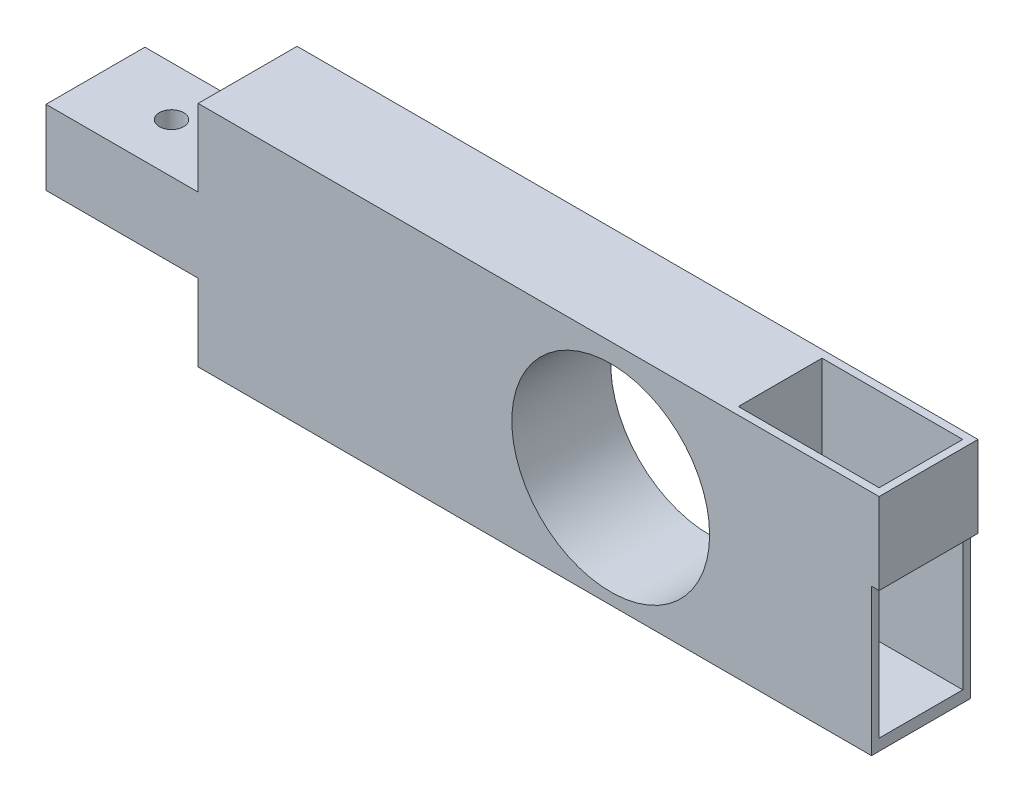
ISO-10303-21;
HEADER;
FILE_DESCRIPTION(('STEP AP214'),'2;1');
FILE_NAME('part.step','',(''),(''),'','','');
FILE_SCHEMA(('AUTOMOTIVE_DESIGN { 1 0 10303 214 1 1 1 1 }'));
ENDSEC;
DATA;
#1=APPLICATION_CONTEXT('core data for automotive mechanical design processes');
#2=APPLICATION_PROTOCOL_DEFINITION('international standard','automotive_design',2000,#1);
#3=PRODUCT_CONTEXT('',#1,'mechanical');
#4=PRODUCT('Part','Part','',(#3));
#5=PRODUCT_RELATED_PRODUCT_CATEGORY('part','',(#4));
#6=PRODUCT_DEFINITION_FORMATION('','',#4);
#7=PRODUCT_DEFINITION_CONTEXT('part definition',#1,'design');
#8=PRODUCT_DEFINITION('design','',#6,#7);
#9=PRODUCT_DEFINITION_SHAPE('','',#8);
#10=(LENGTH_UNIT() NAMED_UNIT(*) SI_UNIT(.MILLI.,.METRE.));
#11=(NAMED_UNIT(*) PLANE_ANGLE_UNIT() SI_UNIT($,.RADIAN.));
#12=(NAMED_UNIT(*) SI_UNIT($,.STERADIAN.) SOLID_ANGLE_UNIT());
#13=UNCERTAINTY_MEASURE_WITH_UNIT(LENGTH_MEASURE(1.E-05),#10,'distance_accuracy_value','');
#14=(GEOMETRIC_REPRESENTATION_CONTEXT(3) GLOBAL_UNCERTAINTY_ASSIGNED_CONTEXT((#13)) GLOBAL_UNIT_ASSIGNED_CONTEXT((#10,
#11,#12)) REPRESENTATION_CONTEXT('',''));
#15=CARTESIAN_POINT('',(0.,0.,0.));
#16=DIRECTION('',(0.,0.,1.));
#17=DIRECTION('',(1.,0.,0.));
#18=AXIS2_PLACEMENT_3D('',#15,#16,#17);
#19=CARTESIAN_POINT('',(350.325,30.,0.));
#20=DIRECTION('',(-1.,0.,0.));
#21=DIRECTION('',(0.,0.,1.));
#22=AXIS2_PLACEMENT_3D('',#19,#20,#21);
#23=PLANE('',#22);
#24=DIRECTION('',(0.,0.,-1.));
#25=VECTOR('',#24,1.);
#26=CARTESIAN_POINT('',(350.325,30.,0.));
#27=LINE('',#26,#25);
#28=CARTESIAN_POINT('',(350.325,30.,12.));
#29=VERTEX_POINT('',#28);
#30=CARTESIAN_POINT('',(350.325,30.,0.999999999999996));
#31=VERTEX_POINT('',#30);
#32=EDGE_CURVE('E164',#29,#31,#27,.T.);
#33=ORIENTED_EDGE('',*,*,#32,.F.);
#34=DIRECTION('',(0.,1.,0.));
#35=VECTOR('',#34,1.);
#36=CARTESIAN_POINT('',(350.325,-17.0172369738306,12.));
#37=LINE('',#36,#35);
#38=CARTESIAN_POINT('',(350.325,1.50000000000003,12.));
#39=VERTEX_POINT('',#38);
#40=EDGE_CURVE('E195',#39,#29,#37,.T.);
#41=ORIENTED_EDGE('',*,*,#40,.F.);
#42=DIRECTION('',(0.,0.,1.));
#43=VECTOR('',#42,1.);
#44=CARTESIAN_POINT('',(350.325,1.50000000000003,11.25));
#45=LINE('',#44,#43);
#46=CARTESIAN_POINT('',(350.325,1.50000000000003,0.999999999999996));
#47=VERTEX_POINT('',#46);
#48=EDGE_CURVE('E182',#47,#39,#45,.T.);
#49=ORIENTED_EDGE('',*,*,#48,.F.);
#50=DIRECTION('',(0.,1.,0.));
#51=VECTOR('',#50,1.);
#52=CARTESIAN_POINT('',(350.325,-17.0172369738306,0.999999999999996));
#53=LINE('',#52,#51);
#54=EDGE_CURVE('E181',#47,#31,#53,.T.);
#55=ORIENTED_EDGE('',*,*,#54,.T.);
#56=EDGE_LOOP('',(#33,#41,#49,#55));
#57=FACE_BOUND('',#56,.T.);
#58=ADVANCED_FACE('F39',(#57),#23,.F.);
#59=CARTESIAN_POINT('',(0.,0.,13.));
#60=DIRECTION('',(0.,1.,0.));
#61=DIRECTION('',(0.,0.,1.));
#62=AXIS2_PLACEMENT_3D('',#59,#60,#61);
#63=PLANE('',#62);
#64=DIRECTION('',(1.,0.,0.));
#65=VECTOR('',#64,1.);
#66=CARTESIAN_POINT('',(0.,0.,13.));
#67=LINE('',#66,#65);
#68=CARTESIAN_POINT('',(280.325,0.,13.));
#69=VERTEX_POINT('',#68);
#70=CARTESIAN_POINT('',(368.825,0.,13.));
#71=VERTEX_POINT('',#70);
#72=EDGE_CURVE('E293',#69,#71,#67,.T.);
#73=ORIENTED_EDGE('',*,*,#72,.F.);
#74=DIRECTION('',(0.,0.,1.));
#75=VECTOR('',#74,1.);
#76=CARTESIAN_POINT('',(280.325,0.,0.));
#77=LINE('',#76,#75);
#78=CARTESIAN_POINT('',(280.325,0.,0.));
#79=VERTEX_POINT('',#78);
#80=EDGE_CURVE('E266',#79,#69,#77,.T.);
#81=ORIENTED_EDGE('',*,*,#80,.F.);
#82=DIRECTION('',(1.,0.,0.));
#83=VECTOR('',#82,1.);
#84=CARTESIAN_POINT('',(0.,0.,0.));
#85=LINE('',#84,#83);
#86=CARTESIAN_POINT('',(368.825,0.,0.));
#87=VERTEX_POINT('',#86);
#88=EDGE_CURVE('E292',#79,#87,#85,.T.);
#89=ORIENTED_EDGE('',*,*,#88,.T.);
#90=DIRECTION('',(0.,0.,-1.));
#91=VECTOR('',#90,1.);
#92=CARTESIAN_POINT('',(368.825,0.,13.));
#93=LINE('',#92,#91);
#94=EDGE_CURVE('E234',#71,#87,#93,.T.);
#95=ORIENTED_EDGE('',*,*,#94,.F.);
#96=EDGE_LOOP('',(#73,#81,#89,#95));
#97=FACE_BOUND('',#96,.T.);
#98=ADVANCED_FACE('F41',(#97),#63,.F.);
#99=CARTESIAN_POINT('',(0.,30.,13.));
#100=DIRECTION('',(0.,1.,0.));
#101=DIRECTION('',(-1.,0.,0.));
#102=AXIS2_PLACEMENT_3D('',#99,#100,#101);
#103=PLANE('',#102);
#104=DIRECTION('',(-1.,0.,0.));
#105=VECTOR('',#104,1.);
#106=CARTESIAN_POINT('',(350.325,30.,0.999999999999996));
#107=LINE('',#106,#105);
#108=CARTESIAN_POINT('',(368.825,30.,0.999999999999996));
#109=VERTEX_POINT('',#108);
#110=EDGE_CURVE('E170',#109,#31,#107,.T.);
#111=ORIENTED_EDGE('',*,*,#110,.F.);
#112=DIRECTION('',(0.,0.,1.));
#113=VECTOR('',#112,1.);
#114=CARTESIAN_POINT('',(368.825,30.,13.));
#115=LINE('',#114,#113);
#116=CARTESIAN_POINT('',(368.825,30.,11.25));
#117=VERTEX_POINT('',#116);
#118=EDGE_CURVE('E214',#109,#117,#115,.T.);
#119=ORIENTED_EDGE('',*,*,#118,.T.);
#120=DIRECTION('',(-1.,0.,0.));
#121=VECTOR('',#120,1.);
#122=CARTESIAN_POINT('',(350.325,30.,11.25));
#123=LINE('',#122,#121);
#124=CARTESIAN_POINT('',(368.827042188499,30.,11.25));
#125=VERTEX_POINT('',#124);
#126=EDGE_CURVE('E203',#125,#117,#123,.T.);
#127=ORIENTED_EDGE('',*,*,#126,.F.);
#128=DIRECTION('',(0.,0.,-1.));
#129=VECTOR('',#128,1.);
#130=CARTESIAN_POINT('',(368.827042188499,30.,11.25));
#131=LINE('',#130,#129);
#132=CARTESIAN_POINT('',(368.827042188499,30.,12.));
#133=VERTEX_POINT('',#132);
#134=EDGE_CURVE('E191',#133,#125,#131,.T.);
#135=ORIENTED_EDGE('',*,*,#134,.F.);
#136=DIRECTION('',(1.,0.,0.));
#137=VECTOR('',#136,1.);
#138=CARTESIAN_POINT('',(350.325,30.,12.));
#139=LINE('',#138,#137);
#140=EDGE_CURVE('E173',#29,#133,#139,.T.);
#141=ORIENTED_EDGE('',*,*,#140,.F.);
#142=ORIENTED_EDGE('',*,*,#32,.T.);
#143=EDGE_LOOP('',(#111,#119,#127,#135,#141,#142));
#144=FACE_BOUND('',#143,.T.);
#145=DIRECTION('',(1.,0.,0.));
#146=VECTOR('',#145,1.);
#147=CARTESIAN_POINT('',(0.,30.,13.));
#148=LINE('',#147,#146);
#149=CARTESIAN_POINT('',(280.325,30.,13.));
#150=VERTEX_POINT('',#149);
#151=CARTESIAN_POINT('',(369.825,30.,13.));
#152=VERTEX_POINT('',#151);
#153=EDGE_CURVE('E178',#150,#152,#148,.T.);
#154=ORIENTED_EDGE('',*,*,#153,.T.);
#155=DIRECTION('',(0.,0.,1.));
#156=VECTOR('',#155,1.);
#157=CARTESIAN_POINT('',(369.825,30.,13.));
#158=LINE('',#157,#156);
#159=CARTESIAN_POINT('',(369.825,30.,0.));
#160=VERTEX_POINT('',#159);
#161=EDGE_CURVE('E219',#160,#152,#158,.T.);
#162=ORIENTED_EDGE('',*,*,#161,.F.);
#163=DIRECTION('',(1.,0.,0.));
#164=VECTOR('',#163,1.);
#165=CARTESIAN_POINT('',(0.,30.,0.));
#166=LINE('',#165,#164);
#167=CARTESIAN_POINT('',(280.325,30.,0.));
#168=VERTEX_POINT('',#167);
#169=EDGE_CURVE('E296',#168,#160,#166,.T.);
#170=ORIENTED_EDGE('',*,*,#169,.F.);
#171=DIRECTION('',(0.,0.,-1.));
#172=VECTOR('',#171,1.);
#173=CARTESIAN_POINT('',(280.325,30.,0.));
#174=LINE('',#173,#172);
#175=EDGE_CURVE('E272',#150,#168,#174,.T.);
#176=ORIENTED_EDGE('',*,*,#175,.F.);
#177=EDGE_LOOP('',(#154,#162,#170,#176));
#178=FACE_BOUND('',#177,.T.);
#179=ADVANCED_FACE('F166',(#144,#178),#103,.T.);
#180=CARTESIAN_POINT('',(0.,0.,13.));
#181=DIRECTION('',(0.,0.,1.));
#182=DIRECTION('',(1.,0.,0.));
#183=AXIS2_PLACEMENT_3D('',#180,#181,#182);
#184=PLANE('',#183);
#185=ORIENTED_EDGE('',*,*,#72,.T.);
#186=DIRECTION('',(0.,-1.,0.));
#187=VECTOR('',#186,1.);
#188=CARTESIAN_POINT('',(368.825,30.,13.));
#189=LINE('',#188,#187);
#190=CARTESIAN_POINT('',(368.825,19.3,13.));
#191=VERTEX_POINT('',#190);
#192=EDGE_CURVE('E232',#191,#71,#189,.T.);
#193=ORIENTED_EDGE('',*,*,#192,.F.);
#194=DIRECTION('',(-1.,0.,0.));
#195=VECTOR('',#194,1.);
#196=CARTESIAN_POINT('',(369.825,19.3,13.));
#197=LINE('',#196,#195);
#198=CARTESIAN_POINT('',(369.825,19.3,13.));
#199=VERTEX_POINT('',#198);
#200=EDGE_CURVE('E229',#199,#191,#197,.T.);
#201=ORIENTED_EDGE('',*,*,#200,.F.);
#202=DIRECTION('',(0.,-1.,0.));
#203=VECTOR('',#202,1.);
#204=CARTESIAN_POINT('',(369.825,30.,13.));
#205=LINE('',#204,#203);
#206=EDGE_CURVE('E210',#152,#199,#205,.T.);
#207=ORIENTED_EDGE('',*,*,#206,.F.);
#208=ORIENTED_EDGE('',*,*,#153,.F.);
#209=DIRECTION('',(0.,1.,0.));
#210=VECTOR('',#209,1.);
#211=CARTESIAN_POINT('',(280.325,30.,13.));
#212=LINE('',#211,#210);
#213=CARTESIAN_POINT('',(280.325,19.9,13.));
#214=VERTEX_POINT('',#213);
#215=EDGE_CURVE('E269',#214,#150,#212,.T.);
#216=ORIENTED_EDGE('',*,*,#215,.F.);
#217=DIRECTION('',(-1.,0.,0.));
#218=VECTOR('',#217,1.);
#219=CARTESIAN_POINT('',(0.,19.9,13.));
#220=LINE('',#219,#218);
#221=CARTESIAN_POINT('',(260.325,19.9,13.));
#222=VERTEX_POINT('',#221);
#223=EDGE_CURVE('E287',#214,#222,#220,.T.);
#224=ORIENTED_EDGE('',*,*,#223,.T.);
#225=DIRECTION('',(0.,1.,0.));
#226=VECTOR('',#225,1.);
#227=CARTESIAN_POINT('',(260.325,19.9,13.));
#228=LINE('',#227,#226);
#229=CARTESIAN_POINT('',(260.325,10.1,13.));
#230=VERTEX_POINT('',#229);
#231=EDGE_CURVE('E256',#230,#222,#228,.T.);
#232=ORIENTED_EDGE('',*,*,#231,.F.);
#233=DIRECTION('',(-1.,0.,0.));
#234=VECTOR('',#233,1.);
#235=CARTESIAN_POINT('',(0.,10.1,13.));
#236=LINE('',#235,#234);
#237=CARTESIAN_POINT('',(280.325,10.1,13.));
#238=VERTEX_POINT('',#237);
#239=EDGE_CURVE('E282',#238,#230,#236,.T.);
#240=ORIENTED_EDGE('',*,*,#239,.F.);
#241=EDGE_CURVE('E270',#69,#238,#212,.T.);
#242=ORIENTED_EDGE('',*,*,#241,.F.);
#243=EDGE_LOOP('',(#185,#193,#201,#207,#208,#216,#224,#232,#240,#242));
#244=FACE_BOUND('',#243,.T.);
#245=CARTESIAN_POINT('',(334.55,14.5,13.));
#246=DIRECTION('',(0.,0.,1.));
#247=DIRECTION('',(1.,0.,0.));
#248=AXIS2_PLACEMENT_3D('',#245,#246,#247);
#249=CIRCLE('',#248,13.);
#250=CARTESIAN_POINT('',(347.55,14.5,13.));
#251=VERTEX_POINT('',#250);
#252=EDGE_CURVE('E289',#251,#251,#249,.T.);
#253=ORIENTED_EDGE('',*,*,#252,.F.);
#254=EDGE_LOOP('',(#253));
#255=FACE_BOUND('',#254,.T.);
#256=ADVANCED_FACE('F341',(#244,#255),#184,.T.);
#257=CARTESIAN_POINT('',(0.,0.,0.));
#258=DIRECTION('',(0.,0.,1.));
#259=DIRECTION('',(1.,0.,0.));
#260=AXIS2_PLACEMENT_3D('',#257,#258,#259);
#261=PLANE('',#260);
#262=ORIENTED_EDGE('',*,*,#169,.T.);
#263=DIRECTION('',(0.,1.,0.));
#264=VECTOR('',#263,1.);
#265=CARTESIAN_POINT('',(369.825,30.,0.));
#266=LINE('',#265,#264);
#267=CARTESIAN_POINT('',(369.825,19.3,0.));
#268=VERTEX_POINT('',#267);
#269=EDGE_CURVE('E216',#268,#160,#266,.T.);
#270=ORIENTED_EDGE('',*,*,#269,.F.);
#271=DIRECTION('',(-1.,0.,0.));
#272=VECTOR('',#271,1.);
#273=CARTESIAN_POINT('',(369.825,19.3,0.));
#274=LINE('',#273,#272);
#275=CARTESIAN_POINT('',(368.825,19.3,0.));
#276=VERTEX_POINT('',#275);
#277=EDGE_CURVE('E222',#268,#276,#274,.T.);
#278=ORIENTED_EDGE('',*,*,#277,.T.);
#279=DIRECTION('',(0.,1.,0.));
#280=VECTOR('',#279,1.);
#281=CARTESIAN_POINT('',(368.825,0.,0.));
#282=LINE('',#281,#280);
#283=EDGE_CURVE('E237',#87,#276,#282,.T.);
#284=ORIENTED_EDGE('',*,*,#283,.F.);
#285=ORIENTED_EDGE('',*,*,#88,.F.);
#286=DIRECTION('',(0.,-1.,0.));
#287=VECTOR('',#286,1.);
#288=CARTESIAN_POINT('',(280.325,30.,0.));
#289=LINE('',#288,#287);
#290=CARTESIAN_POINT('',(280.325,10.1,0.));
#291=VERTEX_POINT('',#290);
#292=EDGE_CURVE('E262',#291,#79,#289,.T.);
#293=ORIENTED_EDGE('',*,*,#292,.F.);
#294=DIRECTION('',(-1.,0.,0.));
#295=VECTOR('',#294,1.);
#296=CARTESIAN_POINT('',(0.,10.1,0.));
#297=LINE('',#296,#295);
#298=CARTESIAN_POINT('',(260.325,10.1,0.));
#299=VERTEX_POINT('',#298);
#300=EDGE_CURVE('E278',#291,#299,#297,.T.);
#301=ORIENTED_EDGE('',*,*,#300,.T.);
#302=DIRECTION('',(0.,-1.,0.));
#303=VECTOR('',#302,1.);
#304=CARTESIAN_POINT('',(260.325,19.9,0.));
#305=LINE('',#304,#303);
#306=CARTESIAN_POINT('',(260.325,19.9,0.));
#307=VERTEX_POINT('',#306);
#308=EDGE_CURVE('E250',#307,#299,#305,.T.);
#309=ORIENTED_EDGE('',*,*,#308,.F.);
#310=DIRECTION('',(-1.,0.,0.));
#311=VECTOR('',#310,1.);
#312=CARTESIAN_POINT('',(0.,19.9,0.));
#313=LINE('',#312,#311);
#314=CARTESIAN_POINT('',(280.325,19.9,0.));
#315=VERTEX_POINT('',#314);
#316=EDGE_CURVE('E283',#315,#307,#313,.T.);
#317=ORIENTED_EDGE('',*,*,#316,.F.);
#318=EDGE_CURVE('E263',#168,#315,#289,.T.);
#319=ORIENTED_EDGE('',*,*,#318,.F.);
#320=EDGE_LOOP('',(#262,#270,#278,#284,#285,#293,#301,#309,#317,#319));
#321=FACE_BOUND('',#320,.T.);
#322=CARTESIAN_POINT('',(334.55,14.5,0.));
#323=DIRECTION('',(0.,0.,1.));
#324=DIRECTION('',(1.,0.,0.));
#325=AXIS2_PLACEMENT_3D('',#322,#323,#324);
#326=CIRCLE('',#325,13.);
#327=CARTESIAN_POINT('',(347.55,14.5,0.));
#328=VERTEX_POINT('',#327);
#329=EDGE_CURVE('E279',#328,#328,#326,.T.);
#330=ORIENTED_EDGE('',*,*,#329,.T.);
#331=EDGE_LOOP('',(#330));
#332=FACE_BOUND('',#331,.T.);
#333=ADVANCED_FACE('F330',(#321,#332),#261,.F.);
#334=CARTESIAN_POINT('',(0.,19.9,0.));
#335=DIRECTION('',(0.,1.,0.));
#336=DIRECTION('',(-1.,0.,0.));
#337=AXIS2_PLACEMENT_3D('',#334,#335,#336);
#338=PLANE('',#337);
#339=CARTESIAN_POINT('',(270.325,19.9,6.5));
#340=DIRECTION('',(0.,1.,0.));
#341=DIRECTION('',(-1.,0.,0.));
#342=AXIS2_PLACEMENT_3D('',#339,#340,#341);
#343=CIRCLE('',#342,1.59999999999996);
#344=CARTESIAN_POINT('',(268.725,19.9,6.5));
#345=VERTEX_POINT('',#344);
#346=EDGE_CURVE('E245',#345,#345,#343,.T.);
#347=ORIENTED_EDGE('',*,*,#346,.F.);
#348=EDGE_LOOP('',(#347));
#349=FACE_BOUND('',#348,.T.);
#350=DIRECTION('',(0.,0.,1.));
#351=VECTOR('',#350,1.);
#352=CARTESIAN_POINT('',(280.325,19.9,0.));
#353=LINE('',#352,#351);
#354=EDGE_CURVE('E275',#315,#214,#353,.T.);
#355=ORIENTED_EDGE('',*,*,#354,.F.);
#356=ORIENTED_EDGE('',*,*,#316,.T.);
#357=DIRECTION('',(0.,0.,-1.));
#358=VECTOR('',#357,1.);
#359=CARTESIAN_POINT('',(260.325,19.9,0.));
#360=LINE('',#359,#358);
#361=EDGE_CURVE('E259',#222,#307,#360,.T.);
#362=ORIENTED_EDGE('',*,*,#361,.F.);
#363=ORIENTED_EDGE('',*,*,#223,.F.);
#364=EDGE_LOOP('',(#355,#356,#362,#363));
#365=FACE_BOUND('',#364,.T.);
#366=ADVANCED_FACE('F348',(#349,#365),#338,.T.);
#367=CARTESIAN_POINT('',(0.,10.1,0.));
#368=DIRECTION('',(0.,1.,0.));
#369=DIRECTION('',(-1.,0.,0.));
#370=AXIS2_PLACEMENT_3D('',#367,#368,#369);
#371=PLANE('',#370);
#372=CARTESIAN_POINT('',(270.325,10.1,6.5));
#373=DIRECTION('',(0.,1.,0.));
#374=DIRECTION('',(-1.,0.,0.));
#375=AXIS2_PLACEMENT_3D('',#372,#373,#374);
#376=CIRCLE('',#375,1.59999999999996);
#377=CARTESIAN_POINT('',(268.725,10.1,6.5));
#378=VERTEX_POINT('',#377);
#379=EDGE_CURVE('E249',#378,#378,#376,.T.);
#380=ORIENTED_EDGE('',*,*,#379,.T.);
#381=EDGE_LOOP('',(#380));
#382=FACE_BOUND('',#381,.T.);
#383=ORIENTED_EDGE('',*,*,#300,.F.);
#384=DIRECTION('',(0.,0.,1.));
#385=VECTOR('',#384,1.);
#386=CARTESIAN_POINT('',(280.325,10.1,0.));
#387=LINE('',#386,#385);
#388=EDGE_CURVE('E177',#291,#238,#387,.T.);
#389=ORIENTED_EDGE('',*,*,#388,.T.);
#390=ORIENTED_EDGE('',*,*,#239,.T.);
#391=DIRECTION('',(0.,0.,1.));
#392=VECTOR('',#391,1.);
#393=CARTESIAN_POINT('',(260.325,10.1,0.));
#394=LINE('',#393,#392);
#395=EDGE_CURVE('E253',#299,#230,#394,.T.);
#396=ORIENTED_EDGE('',*,*,#395,.F.);
#397=EDGE_LOOP('',(#383,#389,#390,#396));
#398=FACE_BOUND('',#397,.T.);
#399=ADVANCED_FACE('F360',(#382,#398),#371,.F.);
#400=CARTESIAN_POINT('',(334.55,14.5,0.));
#401=DIRECTION('',(0.,0.,1.));
#402=DIRECTION('',(1.,0.,0.));
#403=AXIS2_PLACEMENT_3D('',#400,#401,#402);
#404=CYLINDRICAL_SURFACE('',#403,13.);
#405=CARTESIAN_POINT('',(347.55,14.5,13.));
#406=CARTESIAN_POINT('',(347.55,14.5,12.8645833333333));
#407=CARTESIAN_POINT('',(347.55,14.5,12.7291666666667));
#408=CARTESIAN_POINT('',(347.55,14.5,12.4583333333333));
#409=CARTESIAN_POINT('',(347.55,14.5,12.3229166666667));
#410=CARTESIAN_POINT('',(347.55,14.5,12.0520833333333));
#411=CARTESIAN_POINT('',(347.55,14.5,11.9166666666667));
#412=CARTESIAN_POINT('',(347.55,14.5,11.6458333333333));
#413=CARTESIAN_POINT('',(347.55,14.5,11.5104166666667));
#414=CARTESIAN_POINT('',(347.55,14.5,11.2395833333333));
#415=CARTESIAN_POINT('',(347.55,14.5,11.1041666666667));
#416=CARTESIAN_POINT('',(347.55,14.5,10.8333333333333));
#417=CARTESIAN_POINT('',(347.55,14.5,10.6979166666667));
#418=CARTESIAN_POINT('',(347.55,14.5,10.4270833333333));
#419=CARTESIAN_POINT('',(347.55,14.5,10.2916666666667));
#420=CARTESIAN_POINT('',(347.55,14.5,10.0208333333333));
#421=CARTESIAN_POINT('',(347.55,14.5,9.88541666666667));
#422=CARTESIAN_POINT('',(347.55,14.5,9.61458333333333));
#423=CARTESIAN_POINT('',(347.55,14.5,9.47916666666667));
#424=CARTESIAN_POINT('',(347.55,14.5,9.20833333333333));
#425=CARTESIAN_POINT('',(347.55,14.5,9.07291666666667));
#426=CARTESIAN_POINT('',(347.55,14.5,8.80208333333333));
#427=CARTESIAN_POINT('',(347.55,14.5,8.66666666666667));
#428=CARTESIAN_POINT('',(347.55,14.5,8.39583333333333));
#429=CARTESIAN_POINT('',(347.55,14.5,8.26041666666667));
#430=CARTESIAN_POINT('',(347.55,14.5,7.98958333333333));
#431=CARTESIAN_POINT('',(347.55,14.5,7.85416666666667));
#432=CARTESIAN_POINT('',(347.55,14.5,7.58333333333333));
#433=CARTESIAN_POINT('',(347.55,14.5,7.44791666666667));
#434=CARTESIAN_POINT('',(347.55,14.5,7.17708333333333));
#435=CARTESIAN_POINT('',(347.55,14.5,7.04166666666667));
#436=CARTESIAN_POINT('',(347.55,14.5,6.77083333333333));
#437=CARTESIAN_POINT('',(347.55,14.5,6.63541666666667));
#438=CARTESIAN_POINT('',(347.55,14.5,6.36458333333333));
#439=CARTESIAN_POINT('',(347.55,14.5,6.22916666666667));
#440=CARTESIAN_POINT('',(347.55,14.5,5.95833333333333));
#441=CARTESIAN_POINT('',(347.55,14.5,5.82291666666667));
#442=CARTESIAN_POINT('',(347.55,14.5,5.55208333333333));
#443=CARTESIAN_POINT('',(347.55,14.5,5.41666666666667));
#444=CARTESIAN_POINT('',(347.55,14.5,5.14583333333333));
#445=CARTESIAN_POINT('',(347.55,14.5,5.01041666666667));
#446=CARTESIAN_POINT('',(347.55,14.5,4.73958333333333));
#447=CARTESIAN_POINT('',(347.55,14.5,4.60416666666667));
#448=CARTESIAN_POINT('',(347.55,14.5,4.33333333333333));
#449=CARTESIAN_POINT('',(347.55,14.5,4.19791666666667));
#450=CARTESIAN_POINT('',(347.55,14.5,3.92708333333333));
#451=CARTESIAN_POINT('',(347.55,14.5,3.79166666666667));
#452=CARTESIAN_POINT('',(347.55,14.5,3.52083333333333));
#453=CARTESIAN_POINT('',(347.55,14.5,3.38541666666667));
#454=CARTESIAN_POINT('',(347.55,14.5,3.11458333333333));
#455=CARTESIAN_POINT('',(347.55,14.5,2.97916666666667));
#456=CARTESIAN_POINT('',(347.55,14.5,2.70833333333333));
#457=CARTESIAN_POINT('',(347.55,14.5,2.57291666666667));
#458=CARTESIAN_POINT('',(347.55,14.5,2.30208333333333));
#459=CARTESIAN_POINT('',(347.55,14.5,2.16666666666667));
#460=CARTESIAN_POINT('',(347.55,14.5,1.89583333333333));
#461=CARTESIAN_POINT('',(347.55,14.5,1.76041666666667));
#462=CARTESIAN_POINT('',(347.55,14.5,1.48958333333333));
#463=CARTESIAN_POINT('',(347.55,14.5,1.35416666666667));
#464=CARTESIAN_POINT('',(347.55,14.5,1.08333333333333));
#465=CARTESIAN_POINT('',(347.55,14.5,0.947916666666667));
#466=CARTESIAN_POINT('',(347.55,14.5,0.677083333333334));
#467=CARTESIAN_POINT('',(347.55,14.5,0.541666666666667));
#468=CARTESIAN_POINT('',(347.55,14.5,0.270833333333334));
#469=CARTESIAN_POINT('',(347.55,14.5,0.135416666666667));
#470=CARTESIAN_POINT('',(347.55,14.5,0.));
#471=B_SPLINE_CURVE_WITH_KNOTS('',3,(#405,#406,#407,#408,#409,#410,#411,#412,#413,#414,#415,
#416,#417,#418,#419,#420,#421,#422,#423,#424,#425,#426,#427,#428,#429,#430,#431,#432,#433,#434,
#435,#436,#437,#438,#439,#440,#441,#442,#443,#444,#445,#446,#447,#448,#449,#450,#451,#452,#453,
#454,#455,#456,#457,#458,#459,#460,#461,#462,#463,#464,#465,#466,#467,#468,#469,#470),
.UNSPECIFIED.,.F.,.F.,(4,2,2,2,2,2,2,2,2,2,2,2,2,2,2,2,2,2,2,2,2,2,2,2,2,2,2,2,2,2,2,2,4),(0.,
0.40625,0.812500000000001,1.21875,1.625,2.03125,2.4375,2.84375,3.25,3.65625,4.0625,4.46875,
4.875,5.28125,5.6875,6.09375,6.5,6.90625,7.3125,7.71875,8.125,8.53125,8.9375,9.34375,9.75,
10.15625,10.5625,10.96875,11.375,11.78125,12.1875,12.59375,13.),.UNSPECIFIED.);
#472=EDGE_CURVE('BSEAM386',#251,#328,#471,.T.);
#473=ORIENTED_EDGE('',*,*,#252,.T.);
#474=ORIENTED_EDGE('',*,*,#329,.F.);
#475=ORIENTED_EDGE('',*,*,#472,.T.);
#476=ORIENTED_EDGE('',*,*,#472,.F.);
#477=EDGE_LOOP('',(#473,#475,#474,#476));
#478=FACE_BOUND('',#477,.T.);
#479=ADVANCED_FACE('F386',(#478),#404,.F.);
#480=CARTESIAN_POINT('',(280.325,0.,0.));
#481=DIRECTION('',(-1.,0.,0.));
#482=DIRECTION('',(0.,0.,1.));
#483=AXIS2_PLACEMENT_3D('',#480,#481,#482);
#484=PLANE('',#483);
#485=ORIENTED_EDGE('',*,*,#388,.F.);
#486=ORIENTED_EDGE('',*,*,#292,.T.);
#487=ORIENTED_EDGE('',*,*,#80,.T.);
#488=ORIENTED_EDGE('',*,*,#241,.T.);
#489=EDGE_LOOP('',(#485,#486,#487,#488));
#490=FACE_BOUND('',#489,.T.);
#491=ADVANCED_FACE('F363',(#490),#484,.T.);
#492=ORIENTED_EDGE('',*,*,#318,.T.);
#493=ORIENTED_EDGE('',*,*,#354,.T.);
#494=ORIENTED_EDGE('',*,*,#215,.T.);
#495=ORIENTED_EDGE('',*,*,#175,.T.);
#496=EDGE_LOOP('',(#492,#493,#494,#495));
#497=FACE_BOUND('',#496,.T.);
#498=ADVANCED_FACE('F345',(#497),#484,.T.);
#499=CARTESIAN_POINT('',(260.325,0.,0.));
#500=DIRECTION('',(-1.,0.,0.));
#501=DIRECTION('',(0.,0.,1.));
#502=AXIS2_PLACEMENT_3D('',#499,#500,#501);
#503=PLANE('',#502);
#504=ORIENTED_EDGE('',*,*,#308,.T.);
#505=ORIENTED_EDGE('',*,*,#395,.T.);
#506=ORIENTED_EDGE('',*,*,#231,.T.);
#507=ORIENTED_EDGE('',*,*,#361,.T.);
#508=EDGE_LOOP('',(#504,#505,#506,#507));
#509=FACE_BOUND('',#508,.T.);
#510=ADVANCED_FACE('F355',(#509),#503,.T.);
#511=CARTESIAN_POINT('',(270.325,0.,6.5));
#512=DIRECTION('',(0.,1.,0.));
#513=DIRECTION('',(-1.,0.,0.));
#514=AXIS2_PLACEMENT_3D('',#511,#512,#513);
#515=CYLINDRICAL_SURFACE('',#514,1.59999999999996);
#516=ORIENTED_EDGE('',*,*,#346,.T.);
#517=EDGE_LOOP('',(#516));
#518=FACE_BOUND('',#517,.T.);
#519=ORIENTED_EDGE('',*,*,#379,.F.);
#520=EDGE_LOOP('',(#519));
#521=FACE_BOUND('',#520,.T.);
#522=ADVANCED_FACE('F379',(#518,#521),#515,.F.);
#523=CARTESIAN_POINT('',(368.825,1.50000000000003,11.25));
#524=DIRECTION('',(0.,-1.,0.));
#525=DIRECTION('',(0.,0.,-1.));
#526=AXIS2_PLACEMENT_3D('',#523,#524,#525);
#527=PLANE('',#526);
#528=ORIENTED_EDGE('',*,*,#48,.T.);
#529=DIRECTION('',(1.,0.,0.));
#530=VECTOR('',#529,1.);
#531=CARTESIAN_POINT('',(350.325,1.50000000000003,12.));
#532=LINE('',#531,#530);
#533=CARTESIAN_POINT('',(368.825,1.50000000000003,12.));
#534=VERTEX_POINT('',#533);
#535=EDGE_CURVE('E200',#39,#534,#532,.T.);
#536=ORIENTED_EDGE('',*,*,#535,.T.);
#537=DIRECTION('',(0.,0.,1.));
#538=VECTOR('',#537,1.);
#539=CARTESIAN_POINT('',(368.825,1.50000000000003,11.25));
#540=LINE('',#539,#538);
#541=CARTESIAN_POINT('',(368.825,1.50000000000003,0.999999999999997));
#542=VERTEX_POINT('',#541);
#543=EDGE_CURVE('E240',#542,#534,#540,.T.);
#544=ORIENTED_EDGE('',*,*,#543,.F.);
#545=DIRECTION('',(-1.,0.,0.));
#546=VECTOR('',#545,1.);
#547=CARTESIAN_POINT('',(350.325,1.50000000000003,0.999999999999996));
#548=LINE('',#547,#546);
#549=EDGE_CURVE('E185',#542,#47,#548,.T.);
#550=ORIENTED_EDGE('',*,*,#549,.T.);
#551=EDGE_LOOP('',(#528,#536,#544,#550));
#552=FACE_BOUND('',#551,.T.);
#553=ADVANCED_FACE('F377',(#552),#527,.F.);
#554=CARTESIAN_POINT('',(368.825,0.,0.));
#555=DIRECTION('',(1.,0.,0.));
#556=DIRECTION('',(0.,0.,-1.));
#557=AXIS2_PLACEMENT_3D('',#554,#555,#556);
#558=PLANE('',#557);
#559=DIRECTION('',(0.,1.,0.));
#560=VECTOR('',#559,1.);
#561=CARTESIAN_POINT('',(368.825,-17.0172369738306,0.999999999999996));
#562=LINE('',#561,#560);
#563=CARTESIAN_POINT('',(368.825,19.3,0.999999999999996));
#564=VERTEX_POINT('',#563);
#565=EDGE_CURVE('E54',#542,#564,#562,.T.);
#566=ORIENTED_EDGE('',*,*,#565,.F.);
#567=ORIENTED_EDGE('',*,*,#543,.T.);
#568=DIRECTION('',(0.,-1.,0.));
#569=VECTOR('',#568,1.);
#570=CARTESIAN_POINT('',(368.825,0.,12.));
#571=LINE('',#570,#569);
#572=CARTESIAN_POINT('',(368.825,19.3,12.));
#573=VERTEX_POINT('',#572);
#574=EDGE_CURVE('E184',#573,#534,#571,.T.);
#575=ORIENTED_EDGE('',*,*,#574,.F.);
#576=DIRECTION('',(0.,0.,-1.));
#577=VECTOR('',#576,1.);
#578=CARTESIAN_POINT('',(368.825,19.3,13.));
#579=LINE('',#578,#577);
#580=EDGE_CURVE('E62',#191,#573,#579,.T.);
#581=ORIENTED_EDGE('',*,*,#580,.F.);
#582=ORIENTED_EDGE('',*,*,#192,.T.);
#583=ORIENTED_EDGE('',*,*,#94,.T.);
#584=ORIENTED_EDGE('',*,*,#283,.T.);
#585=EDGE_CURVE('E224',#564,#276,#579,.T.);
#586=ORIENTED_EDGE('',*,*,#585,.F.);
#587=EDGE_LOOP('',(#566,#567,#575,#581,#582,#583,#584,#586));
#588=FACE_BOUND('',#587,.T.);
#589=ADVANCED_FACE('F327',(#588),#558,.T.);
#590=CARTESIAN_POINT('',(368.825,0.,0.));
#591=DIRECTION('',(1.,0.,0.));
#592=DIRECTION('',(0.,0.,-1.));
#593=AXIS2_PLACEMENT_3D('',#590,#591,#592);
#594=PLANE('',#593);
#595=ORIENTED_EDGE('',*,*,#118,.F.);
#596=EDGE_CURVE('E188',#564,#109,#562,.T.);
#597=ORIENTED_EDGE('',*,*,#596,.F.);
#598=CARTESIAN_POINT('',(368.825,19.3,11.25));
#599=VERTEX_POINT('',#598);
#600=EDGE_CURVE('E225',#599,#564,#579,.T.);
#601=ORIENTED_EDGE('',*,*,#600,.F.);
#602=DIRECTION('',(0.,1.,0.));
#603=VECTOR('',#602,1.);
#604=CARTESIAN_POINT('',(368.825,30.,11.25));
#605=LINE('',#604,#603);
#606=EDGE_CURVE('E242',#599,#117,#605,.T.);
#607=ORIENTED_EDGE('',*,*,#606,.T.);
#608=EDGE_LOOP('',(#595,#597,#601,#607));
#609=FACE_BOUND('',#608,.T.);
#610=ADVANCED_FACE('F322',(#609),#594,.F.);
#611=CARTESIAN_POINT('',(369.825,19.3,13.));
#612=DIRECTION('',(0.,1.,0.));
#613=DIRECTION('',(0.,0.,1.));
#614=AXIS2_PLACEMENT_3D('',#611,#612,#613);
#615=PLANE('',#614);
#616=ORIENTED_EDGE('',*,*,#580,.T.);
#617=DIRECTION('',(1.,0.,0.));
#618=VECTOR('',#617,1.);
#619=CARTESIAN_POINT('',(369.825,19.3,12.));
#620=LINE('',#619,#618);
#621=CARTESIAN_POINT('',(368.827042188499,19.3,12.));
#622=VERTEX_POINT('',#621);
#623=EDGE_CURVE('E11',#573,#622,#620,.T.);
#624=ORIENTED_EDGE('',*,*,#623,.T.);
#625=DIRECTION('',(0.,0.,-1.));
#626=VECTOR('',#625,1.);
#627=CARTESIAN_POINT('',(368.827042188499,19.3,13.));
#628=LINE('',#627,#626);
#629=CARTESIAN_POINT('',(368.827042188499,19.3,11.25));
#630=VERTEX_POINT('',#629);
#631=EDGE_CURVE('E47',#622,#630,#628,.T.);
#632=ORIENTED_EDGE('',*,*,#631,.T.);
#633=DIRECTION('',(-1.,0.,0.));
#634=VECTOR('',#633,1.);
#635=CARTESIAN_POINT('',(369.825,19.3,11.25));
#636=LINE('',#635,#634);
#637=EDGE_CURVE('E304',#630,#599,#636,.T.);
#638=ORIENTED_EDGE('',*,*,#637,.T.);
#639=ORIENTED_EDGE('',*,*,#600,.T.);
#640=ORIENTED_EDGE('',*,*,#585,.T.);
#641=ORIENTED_EDGE('',*,*,#277,.F.);
#642=DIRECTION('',(0.,0.,-1.));
#643=VECTOR('',#642,1.);
#644=CARTESIAN_POINT('',(369.825,19.3,13.));
#645=LINE('',#644,#643);
#646=EDGE_CURVE('E213',#199,#268,#645,.T.);
#647=ORIENTED_EDGE('',*,*,#646,.F.);
#648=ORIENTED_EDGE('',*,*,#200,.T.);
#649=EDGE_LOOP('',(#616,#624,#632,#638,#639,#640,#641,#647,#648));
#650=FACE_BOUND('',#649,.T.);
#651=ADVANCED_FACE('F308',(#650),#615,.F.);
#652=CARTESIAN_POINT('',(369.825,0.,0.));
#653=DIRECTION('',(1.,0.,0.));
#654=DIRECTION('',(0.,0.,-1.));
#655=AXIS2_PLACEMENT_3D('',#652,#653,#654);
#656=PLANE('',#655);
#657=ORIENTED_EDGE('',*,*,#206,.T.);
#658=ORIENTED_EDGE('',*,*,#646,.T.);
#659=ORIENTED_EDGE('',*,*,#269,.T.);
#660=ORIENTED_EDGE('',*,*,#161,.T.);
#661=EDGE_LOOP('',(#657,#658,#659,#660));
#662=FACE_BOUND('',#661,.T.);
#663=ADVANCED_FACE('F335',(#662),#656,.T.);
#664=CARTESIAN_POINT('',(368.827042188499,-17.0172369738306,11.25));
#665=DIRECTION('',(1.,0.,0.));
#666=DIRECTION('',(0.,1.,0.));
#667=AXIS2_PLACEMENT_3D('',#664,#665,#666);
#668=PLANE('',#667);
#669=DIRECTION('',(0.,1.,0.));
#670=VECTOR('',#669,1.);
#671=CARTESIAN_POINT('',(368.827042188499,-17.0172369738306,12.));
#672=LINE('',#671,#670);
#673=EDGE_CURVE('E198',#622,#133,#672,.T.);
#674=ORIENTED_EDGE('',*,*,#673,.T.);
#675=ORIENTED_EDGE('',*,*,#134,.T.);
#676=DIRECTION('',(0.,1.,0.));
#677=VECTOR('',#676,1.);
#678=CARTESIAN_POINT('',(368.827042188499,-17.0172369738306,11.25));
#679=LINE('',#678,#677);
#680=EDGE_CURVE('E197',#630,#125,#679,.T.);
#681=ORIENTED_EDGE('',*,*,#680,.F.);
#682=ORIENTED_EDGE('',*,*,#631,.F.);
#683=EDGE_LOOP('',(#674,#675,#681,#682));
#684=FACE_BOUND('',#683,.T.);
#685=ADVANCED_FACE('F313',(#684),#668,.F.);
#686=CARTESIAN_POINT('',(350.325,-17.0172369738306,11.25));
#687=DIRECTION('',(0.,0.,-1.));
#688=DIRECTION('',(-1.,0.,0.));
#689=AXIS2_PLACEMENT_3D('',#686,#687,#688);
#690=PLANE('',#689);
#691=ORIENTED_EDGE('',*,*,#637,.F.);
#692=ORIENTED_EDGE('',*,*,#680,.T.);
#693=ORIENTED_EDGE('',*,*,#126,.T.);
#694=ORIENTED_EDGE('',*,*,#606,.F.);
#695=EDGE_LOOP('',(#691,#692,#693,#694));
#696=FACE_BOUND('',#695,.T.);
#697=ADVANCED_FACE('F320',(#696),#690,.F.);
#698=CARTESIAN_POINT('',(350.325,-17.0172369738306,12.));
#699=DIRECTION('',(0.,0.,1.));
#700=DIRECTION('',(1.,0.,0.));
#701=AXIS2_PLACEMENT_3D('',#698,#699,#700);
#702=PLANE('',#701);
#703=ORIENTED_EDGE('',*,*,#574,.T.);
#704=ORIENTED_EDGE('',*,*,#535,.F.);
#705=ORIENTED_EDGE('',*,*,#40,.T.);
#706=ORIENTED_EDGE('',*,*,#140,.T.);
#707=ORIENTED_EDGE('',*,*,#673,.F.);
#708=ORIENTED_EDGE('',*,*,#623,.F.);
#709=EDGE_LOOP('',(#703,#704,#705,#706,#707,#708));
#710=FACE_BOUND('',#709,.T.);
#711=ADVANCED_FACE('F315',(#710),#702,.F.);
#712=CARTESIAN_POINT('',(350.325,-17.0172369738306,0.999999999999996));
#713=DIRECTION('',(0.,0.,-1.));
#714=DIRECTION('',(-1.,0.,0.));
#715=AXIS2_PLACEMENT_3D('',#712,#713,#714);
#716=PLANE('',#715);
#717=ORIENTED_EDGE('',*,*,#565,.T.);
#718=ORIENTED_EDGE('',*,*,#596,.T.);
#719=ORIENTED_EDGE('',*,*,#110,.T.);
#720=ORIENTED_EDGE('',*,*,#54,.F.);
#721=ORIENTED_EDGE('',*,*,#549,.F.);
#722=EDGE_LOOP('',(#717,#718,#719,#720,#721));
#723=FACE_BOUND('',#722,.T.);
#724=ADVANCED_FACE('F187',(#723),#716,.F.);
#725=CLOSED_SHELL('',(#58,#98,#179,#256,#333,#366,#399,#479,#491,#498,#510,#522,#553,#589,#610,
#651,#663,#685,#697,#711,#724));
#726=MANIFOLD_SOLID_BREP('B2',#725);
#727=ADVANCED_BREP_SHAPE_REPRESENTATION('',(#18,#726),#14);
#728=SHAPE_DEFINITION_REPRESENTATION(#9,#727);
ENDSEC;
END-ISO-10303-21;
